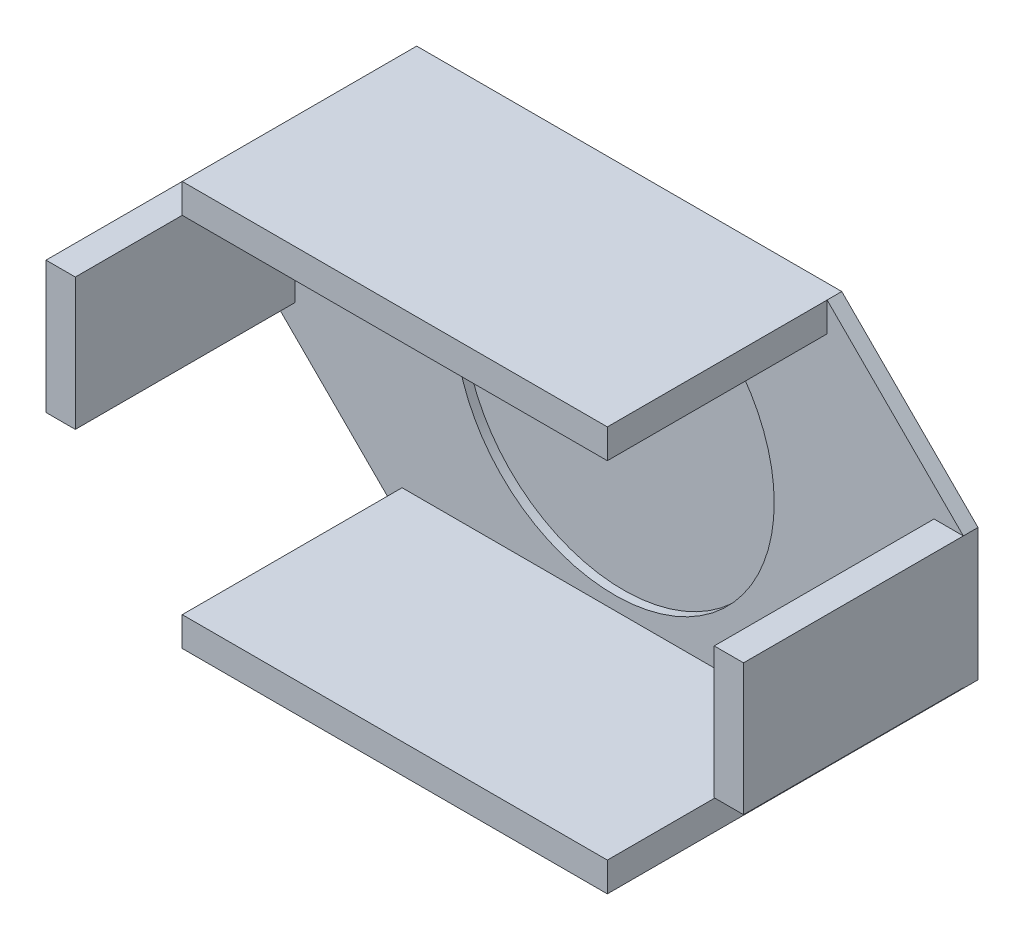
from build123d import *

# Parameters (mm, degrees)
IZIM1_W                     = 50
IZIM1_H                     = 30
Y_KSEKLIK_EKSTR_ZYON1_DEPTH = 60
PAH1_SIZE                   = 10
KES_EKSTR_ZYON1_DEPTH       = 58
IZIM3_R                     = 15
Y_KSEKLIK_EKSTR_ZYON2_DEPTH = 3
IZIM4_R                     = 1
KES_EKSTR_ZYON2_DEPTH       = 8
IZIM5_R                     = 1.6
KES_EKSTR_ZYON3_DEPTH       = 1.6
IZIM6_W                     = 6
IZIM6_H                     = 10.9
KES_EKSTR_ZYON4_DEPTH       = 11.6
IZIM6_3_R                   = 2.5
IZIM6_3_R_2                 = 1
KES_EKSTR_ZYON5_DEPTH       = 0.8
Y_KSEKLIK_EKSTR_ZYON3_DEPTH = 1
IZIM8_W                     = 29.00956353
IZIM8_H                     = 2
IZIM8_W_2                   = 2
IZIM8_H_2                   = 8.972057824
IZIM8_H_3                   = 9.00588745
Y_KSEKLIK_EKSTR_ZYON4_DEPTH = 15
IZIM9_W                     = 96.264592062
IZIM9_H                     = 61.956193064
KES_EKSTR_ZYON6_DEPTH       = 60
IZIM11_R                    = 10.893709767
KES_EKSTR_ZYON7_DEPTH       = 0.6


with BuildPart() as part:
    # izim1 → Y_kseklik-Ekstr_zyon1 (new body)
    with BuildSketch(Plane.XY):
        Rectangle(IZIM1_W, IZIM1_H)
    extrude(amount=Y_KSEKLIK_EKSTR_ZYON1_DEPTH)

    # Pah1
    pah1_edges = [part.edges().sort_by_distance(p)[0] for p in [
        (25, -15, 30),
        (-25, -15, 30),
        (-25, 15, 30),
        (25, 15, 30),
    ]]
    chamfer(pah1_edges, length=PAH1_SIZE)

    # izim2 → Kes-Ekstr_zyon1 (cut)
    with BuildSketch(Plane.XY.offset(60)):
        Polygon((-14.585786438, 14), (14.585786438, 14), (24, 4.585786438), (24, -4.585786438), (14.585786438, -14), (-14.585786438, -14), (-24, -4.585786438), (-24, 4.585786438), align=None)
    extrude(amount=-KES_EKSTR_ZYON1_DEPTH, mode=Mode.SUBTRACT)

    # izim3 → Y_kseklik-Ekstr_zyon2 (add)
    with BuildSketch(Plane(origin=(0, 15, 0), x_dir=(1, 0, 0), z_dir=(0, 1, 0))):
        with Locations(Location((0, -20, 0), (0, 0, 180))):
            Circle(IZIM3_R)
    extrude(amount=Y_KSEKLIK_EKSTR_ZYON2_DEPTH)

    # izim4 → Kes-Ekstr_zyon2 (cut)
    with BuildSketch(Plane(origin=(0, 18, 0), x_dir=(1, 0, 0), z_dir=(0, 1, 0))):
        with Locations(Location((-1.5, -20, 0), (0, 0, 270))):
            Circle(IZIM4_R)
        with Locations(Location((1.5, -20, 0), (0, 0, 270))):
            Circle(IZIM4_R)
    extrude(amount=-KES_EKSTR_ZYON2_DEPTH, mode=Mode.SUBTRACT)

    # izim5 → Kes-Ekstr_zyon3 (cut)
    with BuildSketch(Plane(origin=(0, 18, 0), x_dir=(1, 0, 0), z_dir=(0, 1, 0))):
        with Locations(Location((0, -15, 0), (0, 0, 270))):
            Circle(IZIM5_R)
        with Locations(Location((5, -20, 0), (0, 0, 270))):
            Circle(IZIM5_R)
        with Locations(Location((0, -25, 0), (0, 0, 270))):
            Circle(IZIM5_R)
        with Locations(Location((-5, -20, 0), (0, 0, 270))):
            Circle(IZIM5_R)
    extrude(amount=-KES_EKSTR_ZYON3_DEPTH, mode=Mode.SUBTRACT)

    # izim6 → Kes-Ekstr_zyon4 (cut)
    with BuildSketch(Plane(origin=(0, 0, 0), x_dir=(-1, 0, 0), z_dir=(0, 0, -1))):
        Rectangle(IZIM6_W, IZIM6_H)
    extrude(amount=-KES_EKSTR_ZYON4_DEPTH, mode=Mode.SUBTRACT)

    # izim6_3 → Kes-Ekstr_zyon5 (cut)
    # profile 1 of 2: a face of its own
    with BuildSketch(Plane(origin=(0, 0, 0), x_dir=(-1, 0, 0), z_dir=(0, 0, -1))):
        with Locations((0, 10)):
            Circle(IZIM6_3_R)
        with Locations((0.883883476, 9.116116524)):
            Circle(IZIM6_3_R_2, mode=Mode.SUBTRACT)
        with Locations((-0.883883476, 10.883883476)):
            Circle(IZIM6_3_R_2, mode=Mode.SUBTRACT)
    # profile 2 of 2: a face of its own
    with BuildSketch(Plane(origin=(0, 0, 0), x_dir=(-1, 0, 0), z_dir=(0, 0, -1))):
        with Locations((0, -10)):
            Circle(IZIM6_3_R)
        with Locations((0, -10)):
            Circle(IZIM6_3_R_2, mode=Mode.SUBTRACT)
    extrude(amount=-KES_EKSTR_ZYON5_DEPTH, mode=Mode.SUBTRACT)

    # izim9 → Kes-Ekstr_zyon6 (cut)
    with BuildSketch(Plane(origin=(0, 0, 0), x_dir=(-1, 0, 0), z_dir=(0, 0, -1))):
        with Locations((0.115756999, -1.327615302)):
            Rectangle(IZIM9_W, IZIM9_H)
    extrude(amount=-KES_EKSTR_ZYON6_DEPTH, mode=Mode.SUBTRACT)


with BuildPart() as body_2:
    # izim7 → Y_kseklik-Ekstr_zyon3 (new body)
    with BuildSketch(Plane.XY.offset(60)):
        Polygon((-14.502943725, 13.8), (-23.8, 4.502943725), (-23.8, -4.502943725), (-14.502943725, -13.8), (14.502943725, -13.8), (23.8, -4.502943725), (23.8, 4.502943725), (14.502943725, 13.8), align=None)
    extrude(amount=Y_KSEKLIK_EKSTR_ZYON3_DEPTH)

    # izim8 → Y_kseklik-Ekstr_zyon4 (add)
    with BuildSketch(Plane.XY.offset(61)):
        with Locations((0.00183804, 12.8)):
            Rectangle(IZIM8_W, IZIM8_H)
        with Locations((22.8, 0.016914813)):
            Rectangle(IZIM8_W_2, IZIM8_H_2)
        with Locations((0.00183804, -12.8)):
            Rectangle(IZIM8_W, IZIM8_H)
        with Locations((-22.8, 0)):
            Rectangle(IZIM8_W_2, IZIM8_H_3)
    extrude(amount=Y_KSEKLIK_EKSTR_ZYON4_DEPTH)

    # izim11 → Kes-Ekstr_zyon7 (cut)
    with BuildSketch(Plane.XY.offset(61)):
        Circle(IZIM11_R)
    extrude(amount=-KES_EKSTR_ZYON7_DEPTH, mode=Mode.SUBTRACT)


solid = body_2.part
